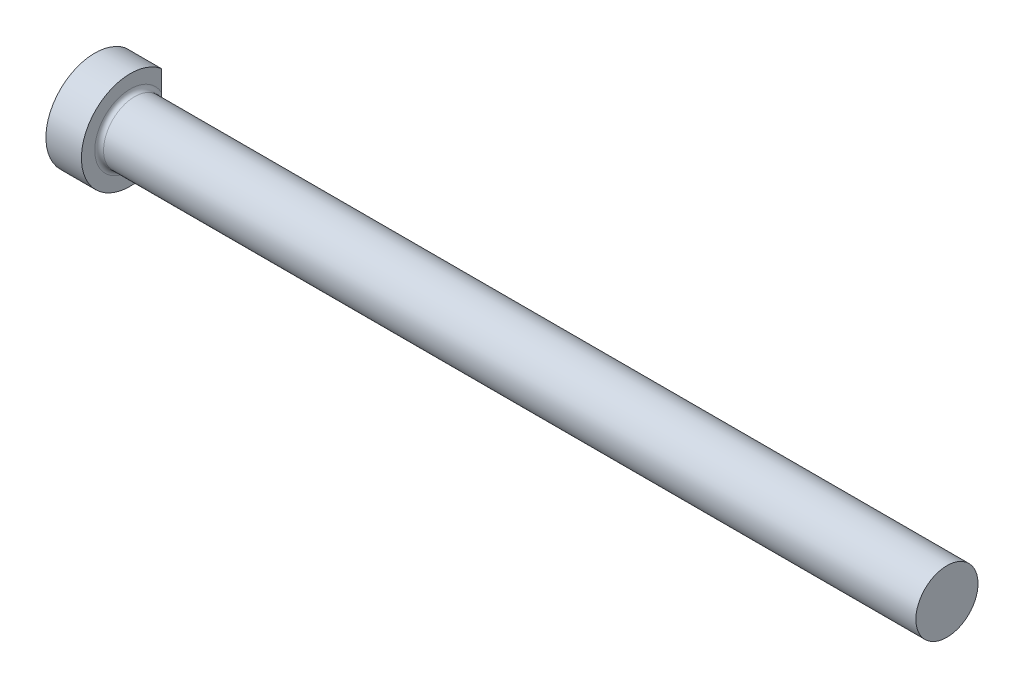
ISO-10303-21;
HEADER;
FILE_DESCRIPTION(('STEP AP214'),'2;1');
FILE_NAME('part.step','',(''),(''),'','','');
FILE_SCHEMA(('AUTOMOTIVE_DESIGN { 1 0 10303 214 1 1 1 1 }'));
ENDSEC;
DATA;
#1=APPLICATION_CONTEXT('core data for automotive mechanical design processes');
#2=APPLICATION_PROTOCOL_DEFINITION('international standard','automotive_design',2000,#1);
#3=PRODUCT_CONTEXT('',#1,'mechanical');
#4=PRODUCT('Part','Part','',(#3));
#5=PRODUCT_RELATED_PRODUCT_CATEGORY('part','',(#4));
#6=PRODUCT_DEFINITION_FORMATION('','',#4);
#7=PRODUCT_DEFINITION_CONTEXT('part definition',#1,'design');
#8=PRODUCT_DEFINITION('design','',#6,#7);
#9=PRODUCT_DEFINITION_SHAPE('','',#8);
#10=(LENGTH_UNIT() NAMED_UNIT(*) SI_UNIT(.MILLI.,.METRE.));
#11=(NAMED_UNIT(*) PLANE_ANGLE_UNIT() SI_UNIT($,.RADIAN.));
#12=(NAMED_UNIT(*) SI_UNIT($,.STERADIAN.) SOLID_ANGLE_UNIT());
#13=UNCERTAINTY_MEASURE_WITH_UNIT(LENGTH_MEASURE(1.E-05),#10,'distance_accuracy_value','');
#14=(GEOMETRIC_REPRESENTATION_CONTEXT(3) GLOBAL_UNCERTAINTY_ASSIGNED_CONTEXT((#13)) GLOBAL_UNIT_ASSIGNED_CONTEXT((#10,
#11,#12)) REPRESENTATION_CONTEXT('',''));
#15=CARTESIAN_POINT('',(0.,0.,0.));
#16=DIRECTION('',(0.,0.,1.));
#17=DIRECTION('',(1.,0.,0.));
#18=AXIS2_PLACEMENT_3D('',#15,#16,#17);
#19=CARTESIAN_POINT('',(0.,0.,0.));
#20=DIRECTION('',(1.,0.,0.));
#21=DIRECTION('',(0.,1.,0.));
#22=AXIS2_PLACEMENT_3D('',#19,#20,#21);
#23=PLANE('',#22);
#24=DIRECTION('',(0.,1.,0.));
#25=VECTOR('',#24,1.);
#26=CARTESIAN_POINT('',(0.,0.,-5.55650400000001));
#27=LINE('',#26,#25);
#28=CARTESIAN_POINT('',(0.,-6.73498254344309,-5.55650400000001));
#29=VERTEX_POINT('',#28);
#30=CARTESIAN_POINT('',(0.,6.73498254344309,-5.556504));
#31=VERTEX_POINT('',#30);
#32=EDGE_CURVE('E61',#29,#31,#27,.T.);
#33=ORIENTED_EDGE('',*,*,#32,.F.);
#34=CARTESIAN_POINT('',(0.,0.,0.));
#35=DIRECTION('',(-1.,0.,0.));
#36=DIRECTION('',(0.,-1.,0.));
#37=AXIS2_PLACEMENT_3D('',#34,#35,#36);
#38=CIRCLE('',#37,8.73124999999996);
#39=EDGE_CURVE('E55',#29,#31,#38,.T.);
#40=ORIENTED_EDGE('',*,*,#39,.T.);
#41=EDGE_LOOP('',(#33,#40));
#42=FACE_BOUND('',#41,.T.);
#43=ADVANCED_FACE('F44',(#42),#23,.F.);
#44=CARTESIAN_POINT('',(152.4,0.,0.));
#45=DIRECTION('',(-1.,0.,0.));
#46=DIRECTION('',(0.,-1.,0.));
#47=AXIS2_PLACEMENT_3D('',#44,#45,#46);
#48=CYLINDRICAL_SURFACE('',#47,8.73124999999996);
#49=DIRECTION('',(-1.,0.,0.));
#50=VECTOR('',#49,1.);
#51=CARTESIAN_POINT('',(152.4,-6.73498254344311,-5.55650400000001));
#52=LINE('',#51,#50);
#53=CARTESIAN_POINT('',(6.34999999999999,-6.73498254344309,-5.55650400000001));
#54=VERTEX_POINT('',#53);
#55=EDGE_CURVE('E99',#54,#29,#52,.T.);
#56=ORIENTED_EDGE('',*,*,#55,.F.);
#57=CARTESIAN_POINT('',(6.34999999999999,0.,0.));
#58=DIRECTION('',(-1.,0.,0.));
#59=DIRECTION('',(0.,-1.,0.));
#60=AXIS2_PLACEMENT_3D('',#57,#58,#59);
#61=CIRCLE('',#60,8.73124999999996);
#62=CARTESIAN_POINT('',(6.35,6.73498254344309,-5.556504));
#63=VERTEX_POINT('',#62);
#64=EDGE_CURVE('E87',#54,#63,#61,.T.);
#65=ORIENTED_EDGE('',*,*,#64,.T.);
#66=DIRECTION('',(-1.,0.,0.));
#67=VECTOR('',#66,1.);
#68=CARTESIAN_POINT('',(152.4,6.73498254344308,-5.556504));
#69=LINE('',#68,#67);
#70=EDGE_CURVE('E68',#31,#63,#69,.F.);
#71=ORIENTED_EDGE('',*,*,#70,.F.);
#72=ORIENTED_EDGE('',*,*,#39,.F.);
#73=EDGE_LOOP('',(#56,#65,#71,#72));
#74=FACE_BOUND('',#73,.T.);
#75=ADVANCED_FACE('F109',(#74),#48,.T.);
#76=CARTESIAN_POINT('',(6.35,8.73124999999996,0.));
#77=DIRECTION('',(-1.,0.,0.));
#78=DIRECTION('',(0.,-1.,0.));
#79=AXIS2_PLACEMENT_3D('',#76,#77,#78);
#80=PLANE('',#79);
#81=DIRECTION('',(0.,-1.,0.));
#82=VECTOR('',#81,1.);
#83=CARTESIAN_POINT('',(6.35,8.73124999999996,-5.556504));
#84=LINE('',#83,#82);
#85=CARTESIAN_POINT('',(6.34999999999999,3.06058141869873,-5.556504));
#86=VERTEX_POINT('',#85);
#87=EDGE_CURVE('E96',#63,#86,#84,.T.);
#88=ORIENTED_EDGE('',*,*,#87,.F.);
#89=ORIENTED_EDGE('',*,*,#64,.F.);
#90=CARTESIAN_POINT('',(6.35,-3.06058141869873,-5.55650400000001));
#91=VERTEX_POINT('',#90);
#92=EDGE_CURVE('E92',#91,#54,#84,.T.);
#93=ORIENTED_EDGE('',*,*,#92,.F.);
#94=CARTESIAN_POINT('',(6.34999999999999,0.,0.));
#95=DIRECTION('',(-1.,0.,0.));
#96=DIRECTION('',(0.,-1.,0.));
#97=AXIS2_PLACEMENT_3D('',#94,#95,#96);
#98=CIRCLE('',#97,6.34365);
#99=EDGE_CURVE('E82',#91,#86,#98,.T.);
#100=ORIENTED_EDGE('',*,*,#99,.T.);
#101=EDGE_LOOP('',(#88,#89,#93,#100));
#102=FACE_BOUND('',#101,.T.);
#103=ADVANCED_FACE('F93',(#102),#80,.F.);
#104=CARTESIAN_POINT('',(7.1374,0.,0.));
#105=DIRECTION('',(-1.,0.,0.));
#106=DIRECTION('',(0.,-1.,0.));
#107=AXIS2_PLACEMENT_3D('',#104,#105,#106);
#108=TOROIDAL_SURFACE('',#107,6.34365,0.787399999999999);
#109=CARTESIAN_POINT('',(7.13739999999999,0.,0.));
#110=DIRECTION('',(-1.,0.,0.));
#111=DIRECTION('',(0.,-1.,0.));
#112=AXIS2_PLACEMENT_3D('',#109,#110,#111);
#113=CIRCLE('',#112,5.55625);
#114=CARTESIAN_POINT('',(7.13739999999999,-5.55625,0.));
#115=VERTEX_POINT('',#114);
#116=EDGE_CURVE('E88',#115,#115,#113,.T.);
#117=ORIENTED_EDGE('',*,*,#116,.T.);
#118=EDGE_LOOP('',(#117));
#119=FACE_BOUND('',#118,.T.);
#120=CARTESIAN_POINT('',(7.11740163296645,0.,-5.55650400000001));
#121=CARTESIAN_POINT('',(7.11740576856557,-0.00413007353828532,-5.55650400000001));
#122=CARTESIAN_POINT('',(7.1172185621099,-0.00826023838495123,-5.55650400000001));
#123=CARTESIAN_POINT('',(7.11651357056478,-0.0164975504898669,-5.55650400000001));
#124=CARTESIAN_POINT('',(7.11599522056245,-0.0206046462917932,-5.55650400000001));
#125=CARTESIAN_POINT('',(7.11404525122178,-0.0329143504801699,-5.55650400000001));
#126=CARTESIAN_POINT('',(7.11222039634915,-0.0410513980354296,-5.55650400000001));
#127=CARTESIAN_POINT('',(7.10600153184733,-0.0654782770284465,-5.55650400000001));
#128=CARTESIAN_POINT('',(7.10089267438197,-0.0815662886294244,-5.55650400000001));
#129=CARTESIAN_POINT('',(7.08479066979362,-0.130203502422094,-5.55650400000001));
#130=CARTESIAN_POINT('',(7.07318638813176,-0.162533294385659,-5.55650400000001));
#131=CARTESIAN_POINT('',(7.04938592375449,-0.228192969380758,-5.55650400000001));
#132=CARTESIAN_POINT('',(7.0371828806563,-0.261520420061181,-5.55650400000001));
#133=CARTESIAN_POINT('',(7.01285124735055,-0.32779554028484,-5.55650400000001));
#134=CARTESIAN_POINT('',(7.00072326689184,-0.360743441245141,-5.55650400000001));
#135=CARTESIAN_POINT('',(6.94494101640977,-0.512614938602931,-5.55650400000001));
#136=CARTESIAN_POINT('',(6.90156402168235,-0.631642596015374,-5.55650400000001));
#137=CARTESIAN_POINT('',(6.81668502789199,-0.870902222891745,-5.55650400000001));
#138=CARTESIAN_POINT('',(6.77519112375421,-0.991137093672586,-5.55650400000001));
#139=CARTESIAN_POINT('',(6.69595289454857,-1.23100396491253,-5.55650400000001));
#140=CARTESIAN_POINT('',(6.65816464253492,-1.35062129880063,-5.55650400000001));
#141=CARTESIAN_POINT('',(6.58697638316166,-1.59102161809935,-5.55650400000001));
#142=CARTESIAN_POINT('',(6.55357141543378,-1.71180311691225,-5.55650400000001));
#143=CARTESIAN_POINT('',(6.49185550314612,-1.95749479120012,-5.55650400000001));
#144=CARTESIAN_POINT('',(6.46367167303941,-2.08243753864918,-5.55650400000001));
#145=CARTESIAN_POINT('',(6.41519237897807,-2.33382283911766,-5.55650400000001));
#146=CARTESIAN_POINT('',(6.3948936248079,-2.46026474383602,-5.55650400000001));
#147=CARTESIAN_POINT('',(6.36455835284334,-2.71431542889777,-5.55650400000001));
#148=CARTESIAN_POINT('',(6.35450871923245,-2.84192250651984,-5.55650400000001));
#149=CARTESIAN_POINT('',(6.34953893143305,-3.03349390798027,-5.55650400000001));
#150=CARTESIAN_POINT('',(6.34956241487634,-3.09732692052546,-5.55650400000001));
#151=CARTESIAN_POINT('',(6.35350245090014,-3.22486608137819,-5.55650400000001));
#152=CARTESIAN_POINT('',(6.35741892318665,-3.28857223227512,-5.55650400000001));
#153=CARTESIAN_POINT('',(6.37334213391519,-3.4524286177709,-5.55650400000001));
#154=CARTESIAN_POINT('',(6.38872035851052,-3.55232112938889,-5.55650400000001));
#155=CARTESIAN_POINT('',(6.42265258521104,-3.69950491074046,-5.55650400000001));
#156=CARTESIAN_POINT('',(6.43575241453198,-3.74806820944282,-5.55650400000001));
#157=CARTESIAN_POINT('',(6.46611260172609,-3.84386337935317,-5.55650400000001));
#158=CARTESIAN_POINT('',(6.48336962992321,-3.89109628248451,-5.55650400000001));
#159=CARTESIAN_POINT('',(6.52297300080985,-3.98426072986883,-5.55650400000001));
#160=CARTESIAN_POINT('',(6.54539277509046,-4.030161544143,-5.55650400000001));
#161=CARTESIAN_POINT('',(6.59593670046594,-4.11877499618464,-5.55650400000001));
#162=CARTESIAN_POINT('',(6.62405900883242,-4.16148865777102,-5.55650400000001));
#163=CARTESIAN_POINT('',(6.68126758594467,-4.23491309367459,-5.55650400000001));
#164=CARTESIAN_POINT('',(6.70932538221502,-4.26641666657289,-5.55650400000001));
#165=CARTESIAN_POINT('',(6.77011453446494,-4.324563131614,-5.55650400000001));
#166=CARTESIAN_POINT('',(6.80283730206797,-4.3512147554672,-5.55650400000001));
#167=CARTESIAN_POINT('',(6.8638807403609,-4.39181389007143,-5.55650400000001));
#168=CARTESIAN_POINT('',(6.89119463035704,-4.40726781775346,-5.55650400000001));
#169=CARTESIAN_POINT('',(6.94798953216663,-4.4335221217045,-5.55650400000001));
#170=CARTESIAN_POINT('',(6.9774689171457,-4.44432595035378,-5.55650400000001));
#171=CARTESIAN_POINT('',(7.0381286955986,-4.46052484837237,-5.55650400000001));
#172=CARTESIAN_POINT('',(7.06931967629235,-4.46588098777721,-5.55650400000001));
#173=CARTESIAN_POINT('',(7.13215023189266,-4.47055157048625,-5.55650400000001));
#174=CARTESIAN_POINT('',(7.16378961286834,-4.4698685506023,-5.55650400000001));
#175=CARTESIAN_POINT('',(7.22298402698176,-4.46293445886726,-5.55650400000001));
#176=CARTESIAN_POINT('',(7.25061287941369,-4.45728903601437,-5.55650400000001));
#177=CARTESIAN_POINT('',(7.30460472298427,-4.44166041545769,-5.55650400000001));
#178=CARTESIAN_POINT('',(7.33096728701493,-4.43167576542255,-5.55650400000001));
#179=CARTESIAN_POINT('',(7.38943247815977,-4.40447242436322,-5.55650400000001));
#180=CARTESIAN_POINT('',(7.42094588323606,-4.38599022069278,-5.55650400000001));
#181=CARTESIAN_POINT('',(7.48054453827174,-4.34415394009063,-5.55650400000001));
#182=CARTESIAN_POINT('',(7.50862348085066,-4.320791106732,-5.55650400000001));
#183=CARTESIAN_POINT('',(7.57261389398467,-4.25959520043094,-5.55650400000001));
#184=CARTESIAN_POINT('',(7.60669784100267,-4.21986099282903,-5.55650400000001));
#185=CARTESIAN_POINT('',(7.66827614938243,-4.13562424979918,-5.55650400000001));
#186=CARTESIAN_POINT('',(7.69575756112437,-4.09111258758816,-5.55650400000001));
#187=CARTESIAN_POINT('',(7.76046417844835,-3.97004458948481,-5.55650400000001));
#188=CARTESIAN_POINT('',(7.79292596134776,-3.89096161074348,-5.55650400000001));
#189=CARTESIAN_POINT('',(7.84581488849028,-3.72893355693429,-5.55650400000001));
#190=CARTESIAN_POINT('',(7.86621348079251,-3.64597981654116,-5.55650400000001));
#191=CARTESIAN_POINT('',(7.89610078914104,-3.48530633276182,-5.55650400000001));
#192=CARTESIAN_POINT('',(7.90635386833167,-3.40772292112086,-5.55650400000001));
#193=CARTESIAN_POINT('',(7.92020649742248,-3.25193432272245,-5.55650400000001));
#194=CARTESIAN_POINT('',(7.92380028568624,-3.17372865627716,-5.55650400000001));
#195=CARTESIAN_POINT('',(7.92543759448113,-3.01712527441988,-5.55650400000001));
#196=CARTESIAN_POINT('',(7.92346998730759,-2.93872748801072,-5.55650400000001));
#197=CARTESIAN_POINT('',(7.91484518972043,-2.78218272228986,-5.55650400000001));
#198=CARTESIAN_POINT('',(7.90818649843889,-2.70403583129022,-5.55650400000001));
#199=CARTESIAN_POINT('',(7.88703038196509,-2.51325999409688,-5.55650400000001));
#200=CARTESIAN_POINT('',(7.87035727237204,-2.40087427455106,-5.55650400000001));
#201=CARTESIAN_POINT('',(7.83044317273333,-2.1772629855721,-5.55650400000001));
#202=CARTESIAN_POINT('',(7.8071991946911,-2.06603796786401,-5.55650400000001));
#203=CARTESIAN_POINT('',(7.75568076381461,-1.84547893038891,-5.55650400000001));
#204=CARTESIAN_POINT('',(7.7274372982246,-1.73613757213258,-5.55650400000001));
#205=CARTESIAN_POINT('',(7.66696454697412,-1.51863552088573,-5.55650400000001));
#206=CARTESIAN_POINT('',(7.63473727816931,-1.41047426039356,-5.55650400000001));
#207=CARTESIAN_POINT('',(7.57405955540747,-1.2168600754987,-5.55650400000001));
#208=CARTESIAN_POINT('',(7.54616072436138,-1.13123243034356,-5.55650400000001));
#209=CARTESIAN_POINT('',(7.48882196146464,-0.960368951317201,-5.55650400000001));
#210=CARTESIAN_POINT('',(7.45938001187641,-0.875133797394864,-5.55650400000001));
#211=CARTESIAN_POINT('',(7.39862809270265,-0.702789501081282,-5.55650400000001));
#212=CARTESIAN_POINT('',(7.3672892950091,-0.615690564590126,-5.55650400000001));
#213=CARTESIAN_POINT('',(7.30406481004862,-0.442193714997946,-5.55650400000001));
#214=CARTESIAN_POINT('',(7.27218269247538,-0.355794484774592,-5.55650400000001));
#215=CARTESIAN_POINT('',(7.23202543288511,-0.246240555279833,-5.55650400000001));
#216=CARTESIAN_POINT('',(7.22357742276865,-0.223152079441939,-5.55650400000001));
#217=CARTESIAN_POINT('',(7.20671747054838,-0.176600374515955,-5.55650400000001));
#218=CARTESIAN_POINT('',(7.19830767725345,-0.15313641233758,-5.55650400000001));
#219=CARTESIAN_POINT('',(7.18231236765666,-0.107298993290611,-5.55650400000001));
#220=CARTESIAN_POINT('',(7.17470677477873,-0.0849333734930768,-5.55650400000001));
#221=CARTESIAN_POINT('',(7.16502208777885,-0.0511624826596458,-5.55650400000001));
#222=CARTESIAN_POINT('',(7.16210828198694,-0.0400143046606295,-5.55650400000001));
#223=CARTESIAN_POINT('',(7.15815878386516,-0.0174378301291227,-5.55650400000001));
#224=CARTESIAN_POINT('',(7.15709991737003,-0.0060148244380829,-5.55650400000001));
#225=CARTESIAN_POINT('',(7.15790955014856,0.0170142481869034,-5.55650400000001));
#226=CARTESIAN_POINT('',(7.15985953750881,0.0286166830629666,-5.55650400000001));
#227=CARTESIAN_POINT('',(7.16505316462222,0.0516041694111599,-5.55650400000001));
#228=CARTESIAN_POINT('',(7.16831424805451,0.0629840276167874,-5.55650400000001));
#229=CARTESIAN_POINT('',(7.1789028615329,0.0975984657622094,-5.55650400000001));
#230=CARTESIAN_POINT('',(7.18688239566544,0.120637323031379,-5.55650400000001));
#231=CARTESIAN_POINT('',(7.20362466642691,0.168024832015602,-5.55650400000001));
#232=CARTESIAN_POINT('',(7.21240527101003,0.192366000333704,-5.55650400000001));
#233=CARTESIAN_POINT('',(7.22997579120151,0.240672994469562,-5.55650400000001));
#234=CARTESIAN_POINT('',(7.23876393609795,0.264639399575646,-5.55650400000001));
#235=CARTESIAN_POINT('',(7.28312509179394,0.385498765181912,-5.55650400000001));
#236=CARTESIAN_POINT('',(7.31881409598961,0.482345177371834,-5.55650400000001));
#237=CARTESIAN_POINT('',(7.38937073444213,0.676903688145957,-5.55650400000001));
#238=CARTESIAN_POINT('',(7.42423322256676,0.774617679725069,-5.55650400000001));
#239=CARTESIAN_POINT('',(7.49152253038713,0.968203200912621,-5.55650400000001));
#240=CARTESIAN_POINT('',(7.52398810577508,1.06406118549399,-5.55650400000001));
#241=CARTESIAN_POINT('',(7.58673971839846,1.25635222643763,-5.55650400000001));
#242=CARTESIAN_POINT('',(7.61702857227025,1.35278435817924,-5.55650400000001));
#243=CARTESIAN_POINT('',(7.68027024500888,1.56470221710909,-5.55650400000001));
#244=CARTESIAN_POINT('',(7.71265266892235,1.68036035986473,-5.55650400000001));
#245=CARTESIAN_POINT('',(7.77228288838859,1.91308663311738,-5.55650400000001));
#246=CARTESIAN_POINT('',(7.79952761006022,2.03015556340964,-5.55650400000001));
#247=CARTESIAN_POINT('',(7.84739270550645,2.26582189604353,-5.55650400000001));
#248=CARTESIAN_POINT('',(7.86800471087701,2.38442103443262,-5.556504));
#249=CARTESIAN_POINT('',(7.90066622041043,2.6227490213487,-5.556504));
#250=CARTESIAN_POINT('',(7.9127228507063,2.74247684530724,-5.556504));
#251=CARTESIAN_POINT('',(7.92475620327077,2.96308362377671,-5.556504));
#252=CARTESIAN_POINT('',(7.92637730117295,3.06386454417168,-5.556504));
#253=CARTESIAN_POINT('',(7.91993525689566,3.26540339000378,-5.556504));
#254=CARTESIAN_POINT('',(7.91184941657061,3.36616070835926,-5.556504));
#255=CARTESIAN_POINT('',(7.88309380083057,3.56739114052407,-5.556504));
#256=CARTESIAN_POINT('',(7.86226709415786,3.6678447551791,-5.556504));
#257=CARTESIAN_POINT('',(7.81861040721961,3.81461287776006,-5.556504));
#258=CARTESIAN_POINT('',(7.80203395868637,3.86279157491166,-5.556504));
#259=CARTESIAN_POINT('',(7.76410900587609,3.95720907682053,-5.556504));
#260=CARTESIAN_POINT('',(7.74276668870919,4.00345030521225,-5.556504));
#261=CARTESIAN_POINT('',(7.69818503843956,4.08630226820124,-5.556504));
#262=CARTESIAN_POINT('',(7.67570722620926,4.12331879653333,-5.556504));
#263=CARTESIAN_POINT('',(7.62625860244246,4.19432994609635,-5.556504));
#264=CARTESIAN_POINT('',(7.5992835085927,4.22832163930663,-5.556504));
#265=CARTESIAN_POINT('',(7.54009022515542,4.29226497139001,-5.556504));
#266=CARTESIAN_POINT('',(7.50781128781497,4.32216141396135,-5.556504));
#267=CARTESIAN_POINT('',(7.43820024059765,4.37534550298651,-5.556504));
#268=CARTESIAN_POINT('',(7.4008841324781,4.39865338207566,-5.556504));
#269=CARTESIAN_POINT('',(7.33500591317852,4.43007716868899,-5.556504));
#270=CARTESIAN_POINT('',(7.30762167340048,4.44066816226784,-5.556504));
#271=CARTESIAN_POINT('',(7.25146754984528,4.4571524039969,-5.556504));
#272=CARTESIAN_POINT('',(7.22269874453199,4.46304924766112,-5.556504));
#273=CARTESIAN_POINT('',(7.16446082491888,4.46970425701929,-5.556504));
#274=CARTESIAN_POINT('',(7.13498959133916,4.47044415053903,-5.556504));
#275=CARTESIAN_POINT('',(7.07638544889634,4.46667534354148,-5.556504));
#276=CARTESIAN_POINT('',(7.04725258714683,4.46216592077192,-5.556504));
#277=CARTESIAN_POINT('',(6.99154720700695,4.44859210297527,-5.556504));
#278=CARTESIAN_POINT('',(6.96491874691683,4.43975283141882,-5.556504));
#279=CARTESIAN_POINT('',(6.91329192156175,4.4182022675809,-5.556504));
#280=CARTESIAN_POINT('',(6.88829423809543,4.40548936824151,-5.556504));
#281=CARTESIAN_POINT('',(6.82985886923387,4.37063092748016,-5.556504));
#282=CARTESIAN_POINT('',(6.79743677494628,4.34678260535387,-5.556504));
#283=CARTESIAN_POINT('',(6.73684103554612,4.29420036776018,-5.556504));
#284=CARTESIAN_POINT('',(6.70867665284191,4.26545608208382,-5.556504));
#285=CARTESIAN_POINT('',(6.64360753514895,4.18949706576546,-5.556504));
#286=CARTESIAN_POINT('',(6.60920980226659,4.14014749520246,-5.556504));
#287=CARTESIAN_POINT('',(6.54835122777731,4.03679967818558,-5.556504));
#288=CARTESIAN_POINT('',(6.52190911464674,3.98279084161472,-5.556504));
#289=CARTESIAN_POINT('',(6.47934567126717,3.88056983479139,-5.556504));
#290=CARTESIAN_POINT('',(6.46226141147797,3.83274900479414,-5.556504));
#291=CARTESIAN_POINT('',(6.43228274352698,3.73579818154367,-5.556504));
#292=CARTESIAN_POINT('',(6.41939127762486,3.68666729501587,-5.556504));
#293=CARTESIAN_POINT('',(6.38616986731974,3.53800817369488,-5.556504));
#294=CARTESIAN_POINT('',(6.37130787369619,3.43725252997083,-5.556504));
#295=CARTESIAN_POINT('',(6.35322622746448,3.23894753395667,-5.556504));
#296=CARTESIAN_POINT('',(6.34956334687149,3.14143175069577,-5.556504));
#297=CARTESIAN_POINT('',(6.35051852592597,2.94637801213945,-5.556504));
#298=CARTESIAN_POINT('',(6.35514460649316,2.84884012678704,-5.556504));
#299=CARTESIAN_POINT('',(6.3711055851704,2.6543363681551,-5.556504));
#300=CARTESIAN_POINT('',(6.38244149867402,2.55737058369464,-5.556504));
#301=CARTESIAN_POINT('',(6.41057573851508,2.36430715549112,-5.556504));
#302=CARTESIAN_POINT('',(6.42737110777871,2.26820907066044,-5.55650400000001));
#303=CARTESIAN_POINT('',(6.46467114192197,2.0807244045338,-5.55650400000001));
#304=CARTESIAN_POINT('',(6.48500151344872,1.98930256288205,-5.55650400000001));
#305=CARTESIAN_POINT('',(6.52907222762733,1.80717748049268,-5.55650400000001));
#306=CARTESIAN_POINT('',(6.55281660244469,1.71647522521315,-5.55650400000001));
#307=CARTESIAN_POINT('',(6.60357277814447,1.53401494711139,-5.55650400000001));
#308=CARTESIAN_POINT('',(6.6306409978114,1.44227272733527,-5.55650400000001));
#309=CARTESIAN_POINT('',(6.67288206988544,1.30542816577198,-5.55650400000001));
#310=CARTESIAN_POINT('',(6.68719648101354,1.26005765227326,-5.55650400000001));
#311=CARTESIAN_POINT('',(6.71631966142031,1.16949055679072,-5.55650400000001));
#312=CARTESIAN_POINT('',(6.73112827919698,1.12429392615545,-5.55650400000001));
#313=CARTESIAN_POINT('',(6.76211086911,1.03124832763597,-5.55650400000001));
#314=CARTESIAN_POINT('',(6.77831257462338,0.983408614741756,-5.55650400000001));
#315=CARTESIAN_POINT('',(6.81115102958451,0.887813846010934,-5.55650400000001));
#316=CARTESIAN_POINT('',(6.82778828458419,0.840058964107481,-5.55650400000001));
#317=CARTESIAN_POINT('',(6.86180960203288,0.743521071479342,-5.55650400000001));
#318=CARTESIAN_POINT('',(6.87920200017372,0.694741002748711,-5.55650400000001));
#319=CARTESIAN_POINT('',(6.91418056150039,0.597513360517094,-5.55650400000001));
#320=CARTESIAN_POINT('',(6.93176540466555,0.549065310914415,-5.55650400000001));
#321=CARTESIAN_POINT('',(6.96525135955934,0.457335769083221,-5.55650400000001));
#322=CARTESIAN_POINT('',(6.98113464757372,0.41404777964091,-5.55650400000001));
#323=CARTESIAN_POINT('',(7.01322871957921,0.326740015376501,-5.55650400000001));
#324=CARTESIAN_POINT('',(7.02944040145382,0.282720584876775,-5.55650400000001));
#325=CARTESIAN_POINT('',(7.05286566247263,0.218598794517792,-5.55650400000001));
#326=CARTESIAN_POINT('',(7.06016993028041,0.198530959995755,-5.55650400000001));
#327=CARTESIAN_POINT('',(7.07468693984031,0.158142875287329,-5.55650400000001));
#328=CARTESIAN_POINT('',(7.08189807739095,0.137822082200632,-5.55650400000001));
#329=CARTESIAN_POINT('',(7.09555734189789,0.0980753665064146,-5.55650400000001));
#330=CARTESIAN_POINT('',(7.10202563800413,0.078657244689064,-5.55650400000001));
#331=CARTESIAN_POINT('',(7.11022788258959,0.0492999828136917,-5.55650400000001));
#332=CARTESIAN_POINT('',(7.11269392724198,0.0395773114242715,-5.55650400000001));
#333=CARTESIAN_POINT('',(7.1162708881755,0.0199017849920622,-5.55650400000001));
#334=CARTESIAN_POINT('',(7.11739166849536,0.0099511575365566,-5.55650400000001));
#335=CARTESIAN_POINT('',(7.11740163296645,0.,-5.55650400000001));
#336=B_SPLINE_CURVE_WITH_KNOTS('',3,(#120,#121,#122,#123,#124,#125,#126,#127,#128,#129,#130,
#131,#132,#133,#134,#135,#136,#137,#138,#139,#140,#141,#142,#143,#144,#145,#146,#147,#148,#149,
#150,#151,#152,#153,#154,#155,#156,#157,#158,#159,#160,#161,#162,#163,#164,#165,#166,#167,#168,
#169,#170,#171,#172,#173,#174,#175,#176,#177,#178,#179,#180,#181,#182,#183,#184,#185,#186,#187,
#188,#189,#190,#191,#192,#193,#194,#195,#196,#197,#198,#199,#200,#201,#202,#203,#204,#205,#206,
#207,#208,#209,#210,#211,#212,#213,#214,#215,#216,#217,#218,#219,#220,#221,#222,#223,#224,#225,
#226,#227,#228,#229,#230,#231,#232,#233,#234,#235,#236,#237,#238,#239,#240,#241,#242,#243,#244,
#245,#246,#247,#248,#249,#250,#251,#252,#253,#254,#255,#256,#257,#258,#259,#260,#261,#262,#263,
#264,#265,#266,#267,#268,#269,#270,#271,#272,#273,#274,#275,#276,#277,#278,#279,#280,#281,#282,
#283,#284,#285,#286,#287,#288,#289,#290,#291,#292,#293,#294,#295,#296,#297,#298,#299,#300,#301,
#302,#303,#304,#305,#306,#307,#308,#309,#310,#311,#312,#313,#314,#315,#316,#317,#318,#319,#320,
#321,#322,#323,#324,#325,#326,#327,#328,#329,#330,#331,#332,#333,#334,#335),.UNSPECIFIED.,.T.,
.F.,(4,2,2,2,2,2,2,2,2,2,2,2,2,2,2,2,2,2,2,2,2,2,2,2,2,2,2,2,2,2,2,2,2,2,2,2,2,2,2,2,2,2,2,2,2,
2,2,2,2,2,2,2,2,2,2,2,2,2,2,2,2,2,2,2,2,2,2,2,2,2,2,2,2,2,2,2,2,2,2,2,2,2,2,2,2,2,2,2,2,2,2,2,2,
2,2,2,2,2,2,2,2,2,2,2,2,2,2,4),(0.,0.0123869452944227,0.0247950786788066,0.049771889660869,
0.100377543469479,0.203428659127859,0.309901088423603,0.415228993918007,0.795276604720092,
1.17682744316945,1.55310044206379,1.92894388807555,2.3129915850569,2.69687885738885,
3.0802742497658,3.2716672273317,3.4630562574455,3.76526944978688,3.91602247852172,
4.06665516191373,4.21957947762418,4.37245445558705,4.49859706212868,4.62451036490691,
4.71830022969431,4.81202034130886,4.90640558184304,5.00075117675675,5.08496798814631,
5.16921300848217,5.27820988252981,5.38740401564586,5.54357647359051,5.70005277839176,
5.95507544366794,6.21069932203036,6.44512784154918,6.67975909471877,6.91486014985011,
7.15003645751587,7.4906166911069,7.83135204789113,8.17004507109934,8.50856732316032,
8.77872500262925,9.04924520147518,9.32693523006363,9.60322013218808,9.67697465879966,
9.75175851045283,9.82259366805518,9.85712697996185,9.89122569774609,9.92626424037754,
9.96178525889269,10.0348869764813,10.1125271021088,10.1891050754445,10.4987484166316,
10.8099784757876,11.1135799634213,11.4167812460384,11.7770083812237,12.1374503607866,
12.4983453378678,12.8589393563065,13.1609474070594,13.4636630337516,13.7701844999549,
13.9228392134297,14.0752968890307,14.204945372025,14.3347180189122,14.466096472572,
14.5970669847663,14.6847927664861,14.7724512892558,14.8604202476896,14.9484013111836,
15.0322282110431,15.1160899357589,15.2361576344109,15.35648288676,15.5359426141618,
15.7158215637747,15.8679468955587,16.0201787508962,16.3247665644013,16.6171325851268,
16.9097816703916,17.2024750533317,17.4950101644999,17.7758989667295,18.0571222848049,
18.3440391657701,18.4867621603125,18.6294417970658,18.7809658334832,18.9326743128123,
19.0880369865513,19.2426585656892,19.3809879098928,19.5217190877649,19.5857842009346,
19.650478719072,19.7118419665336,19.7419093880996,19.7717549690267),.UNSPECIFIED.);
#337=EDGE_CURVE('E14',#86,#91,#336,.T.);
#338=ORIENTED_EDGE('',*,*,#337,.F.);
#339=ORIENTED_EDGE('',*,*,#99,.F.);
#340=EDGE_LOOP('',(#338,#339));
#341=FACE_BOUND('',#340,.T.);
#342=ADVANCED_FACE('F84',(#119,#341),#108,.F.);
#343=CARTESIAN_POINT('',(152.4,0.,0.));
#344=DIRECTION('',(-1.,0.,0.));
#345=DIRECTION('',(0.,-1.,0.));
#346=AXIS2_PLACEMENT_3D('',#343,#344,#345);
#347=CYLINDRICAL_SURFACE('',#346,5.55625000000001);
#348=ORIENTED_EDGE('',*,*,#116,.F.);
#349=EDGE_LOOP('',(#348));
#350=FACE_BOUND('',#349,.T.);
#351=CARTESIAN_POINT('',(152.4,0.,0.));
#352=DIRECTION('',(-1.,0.,0.));
#353=DIRECTION('',(0.,-1.,0.));
#354=AXIS2_PLACEMENT_3D('',#351,#352,#353);
#355=CIRCLE('',#354,5.55625000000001);
#356=CARTESIAN_POINT('',(152.4,-5.55625000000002,0.));
#357=VERTEX_POINT('',#356);
#358=EDGE_CURVE('E104',#357,#357,#355,.T.);
#359=ORIENTED_EDGE('',*,*,#358,.T.);
#360=EDGE_LOOP('',(#359));
#361=FACE_BOUND('',#360,.T.);
#362=ADVANCED_FACE('F119',(#350,#361),#347,.T.);
#363=CARTESIAN_POINT('',(152.4,5.55625,0.));
#364=DIRECTION('',(-1.,0.,0.));
#365=DIRECTION('',(0.,-1.,0.));
#366=AXIS2_PLACEMENT_3D('',#363,#364,#365);
#367=PLANE('',#366);
#368=ORIENTED_EDGE('',*,*,#358,.F.);
#369=EDGE_LOOP('',(#368));
#370=FACE_BOUND('',#369,.T.);
#371=ADVANCED_FACE('F123',(#370),#367,.F.);
#372=CARTESIAN_POINT('',(0.,0.,-5.55650400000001));
#373=DIRECTION('',(0.,0.,-1.));
#374=DIRECTION('',(0.,1.,0.));
#375=AXIS2_PLACEMENT_3D('',#372,#373,#374);
#376=PLANE('',#375);
#377=ORIENTED_EDGE('',*,*,#55,.T.);
#378=ORIENTED_EDGE('',*,*,#32,.T.);
#379=ORIENTED_EDGE('',*,*,#70,.T.);
#380=ORIENTED_EDGE('',*,*,#87,.T.);
#381=ORIENTED_EDGE('',*,*,#337,.T.);
#382=ORIENTED_EDGE('',*,*,#92,.T.);
#383=EDGE_LOOP('',(#377,#378,#379,#380,#381,#382));
#384=FACE_BOUND('',#383,.T.);
#385=ADVANCED_FACE('F98',(#384),#376,.T.);
#386=CLOSED_SHELL('',(#43,#75,#103,#342,#362,#371,#385));
#387=MANIFOLD_SOLID_BREP('B2',#386);
#388=ADVANCED_BREP_SHAPE_REPRESENTATION('',(#18,#387),#14);
#389=SHAPE_DEFINITION_REPRESENTATION(#9,#388);
ENDSEC;
END-ISO-10303-21;
